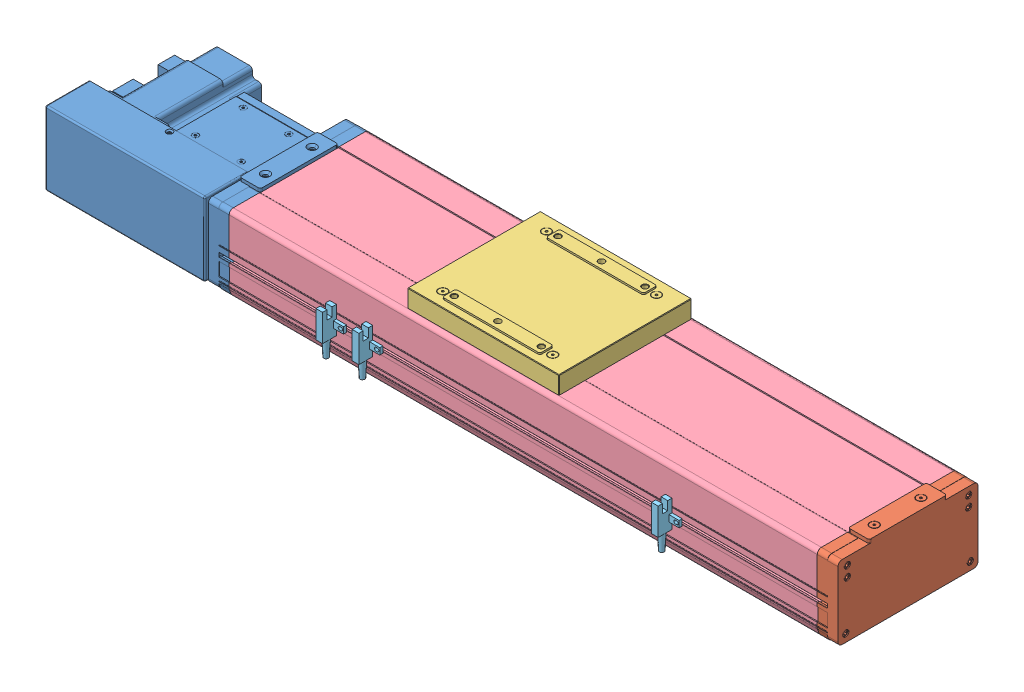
SolidWorks assembly TCD135-T-J4FL-0.SLDASM, configuration 300 (file format 9000). Lengths in mm.
Overall size (766.5 91 150.3).
7 component instances, 5 part files, 19 mates.
Components (placement in the parent):
- TCD135-T-J4FL-1-1: TCD135-T-J4FL-1.sldprt [默认] at (425 0 0)
- TCD135-T-J4FL-2-1: TCD135-T-J4FL-2.sldprt [默认] at (383.5 0 0)
- TCD135-T-J4FL-3-1: TCD135-T-J4FL-3.sldprt [默认] at (383.0068 35.5 0) x (0 0 1) z (-1 0 0)
- TCD135-T-J4FL-4-1: TCD135-T-J4FL-4.SLDPRT [300] at (141.5 1.6 0) x (0 0 1) z (-1 0 0) size (135 71.7 567)
- TCD135-T-J4FL-5-1: TCD135-T-J4FL-5.sldprt [默认] at (385.1996 -3.6004 11) x (0 0 1) z (-1 0 0)
- TCD135-T-J4FL-5-5: TCD135-T-J4FL-5.sldprt [默认] at (708.7996 -3.6004 11) x (0 0 1) z (-1 0 0)
- TCD135-T-J4FL-5-6: TCD135-T-J4FL-5.sldprt [默认] at (420.1996 -3.6004 11) x (0 0 1) z (-1 0 0)
Mates (geometry in assembly coordinates):
- 重合8: coincident aligned: plane of TCD135-T-J4FL-1-1 through (136.5 71.7 51) normal (0 1 0); plane of TCD135-T-J4FL-4-1 through (708.5 71.7 63.5) normal (0 1 0)
- 重合9: coincident aligned: plane of TCD135-T-J4FL-1-1 through (131.5 36.1 67.5) normal (0 0 1); plane of TCD135-T-J4FL-4-1 through (708.5 38.2047 67.5) normal (0 0 1)
- 重合10: coincident anti-aligned: plane of TCD135-T-J4FL-1-1 through (141.5 37.25 0) normal (1 0 0); plane of TCD135-T-J4FL-4-1 through (141.5 67.7 -63.5) normal (-1 0 0)
- 距离3: distance = 3.5 mm aligned: plane of TCD135-T-J4FL-3-1 through (383.0068 80.75 64) normal (0 0 1); plane of TCD135-T-J4FL-4-1 through (708.5 38.2047 67.5) normal (0 0 1)
- 距离4: distance = 91 mm anti-aligned: plane of TCD135-T-J4FL-3-1 through (383.0068 91 50) normal (0 1 0); plane of TCD135-T-J4FL-4-1 through (708.5 0 34.1) normal (0 -1 0)
- 重合11: coincident aligned: plane of TCD135-T-J4FL-2-1 through (718.5 36.1 67.5) normal (0 0 1); plane of TCD135-T-J4FL-4-1 through (708.5 38.2047 67.5) normal (0 0 1)
- 重合12: coincident aligned: plane of TCD135-T-J4FL-2-1 through (713.5 71.7 51) normal (0 1 0); plane of TCD135-T-J4FL-4-1 through (708.5 71.7 63.5) normal (0 1 0)
- 重合13: coincident anti-aligned: plane of TCD135-T-J4FL-2-1 through (708.5 35.85 0) normal (-1 0 0); plane of TCD135-T-J4FL-4-1 through (708.5 67.7 -63.5) normal (1 0 0)
- LimitDistance1: limit distance = 258.5068 mm aligned: plane of TCD135-T-J4FL-3-1 through (310.0068 80.75 0) normal (-1 0 0); plane of TCD135-T-J4FL-1-1 through (51.5 38.5 0) normal (-1 0 0)
- LimitDistance2: limit distance = 272.4932 mm aligned: plane of TCD135-T-J4FL-3-1 through (456.0068 80.75 0) normal (1 0 0); plane of TCD135-T-J4FL-2-1 through (728.5 37.75 0) normal (1 0 0)
- 重合14: coincident anti-aligned: plane of TCD135-T-J4FL-4-1 through (708.5 24.1 67.5) normal (0 0 1); plane of TCD135-T-J4FL-5-1 through (228.7 18.6 67.5) normal (0 0 -1)
- 重合16: coincident aligned: plane of TCD135-T-J4FL-4-1 through (708.5 27.8 67.2) normal (0 1 0); plane of TCD135-T-J4FL-5-1 through (232.1633 27.8 67.5) normal (0 1 0)
- 重合21: coincident anti-aligned: plane of TCD135-T-J4FL-4-1 through (708.5 24.1 67.5) normal (0 0 1); plane of TCD135-T-J4FL-5-5 through (552.3 18.6 67.5) normal (0 0 -1)
- 重合22: coincident aligned: plane of TCD135-T-J4FL-4-1 through (708.5 27.8 67.2) normal (0 1 0); plane of TCD135-T-J4FL-5-5 through (555.7633 27.8 67.5) normal (0 1 0)
- 重合23: coincident anti-aligned: plane of TCD135-T-J4FL-4-1 through (708.5 24.1 67.5) normal (0 0 1); plane of TCD135-T-J4FL-5-6 through (263.7 18.6 67.5) normal (0 0 -1)
- 重合24: coincident aligned: plane of TCD135-T-J4FL-4-1 through (708.5 27.8 67.2) normal (0 1 0); plane of TCD135-T-J4FL-5-6 through (267.1633 27.8 67.5) normal (0 1 0)
- 距离5: distance = 35 mm aligned: plane of TCD135-T-J4FL-5-6 through (273.5 18.6 67.5) normal (-1 0 0); plane of TCD135-T-J4FL-5-1 through (238.5 18.6 67.5) normal (-1 0 0)
- 距离6: distance = 117 mm aligned: plane of TCD135-T-J4FL-1-1 through (121.5 37.5 0) normal (-1 0 0); plane of TCD135-T-J4FL-5-1 through (238.5 18.6 67.5) normal (-1 0 0)
- 距离7: distance = 160 mm aligned: plane of TCD135-T-J4FL-5-5 through (568.5 18.6 67.5) normal (1 0 0); plane of TCD135-T-J4FL-2-1 through (728.5 37.75 0) normal (1 0 0)
